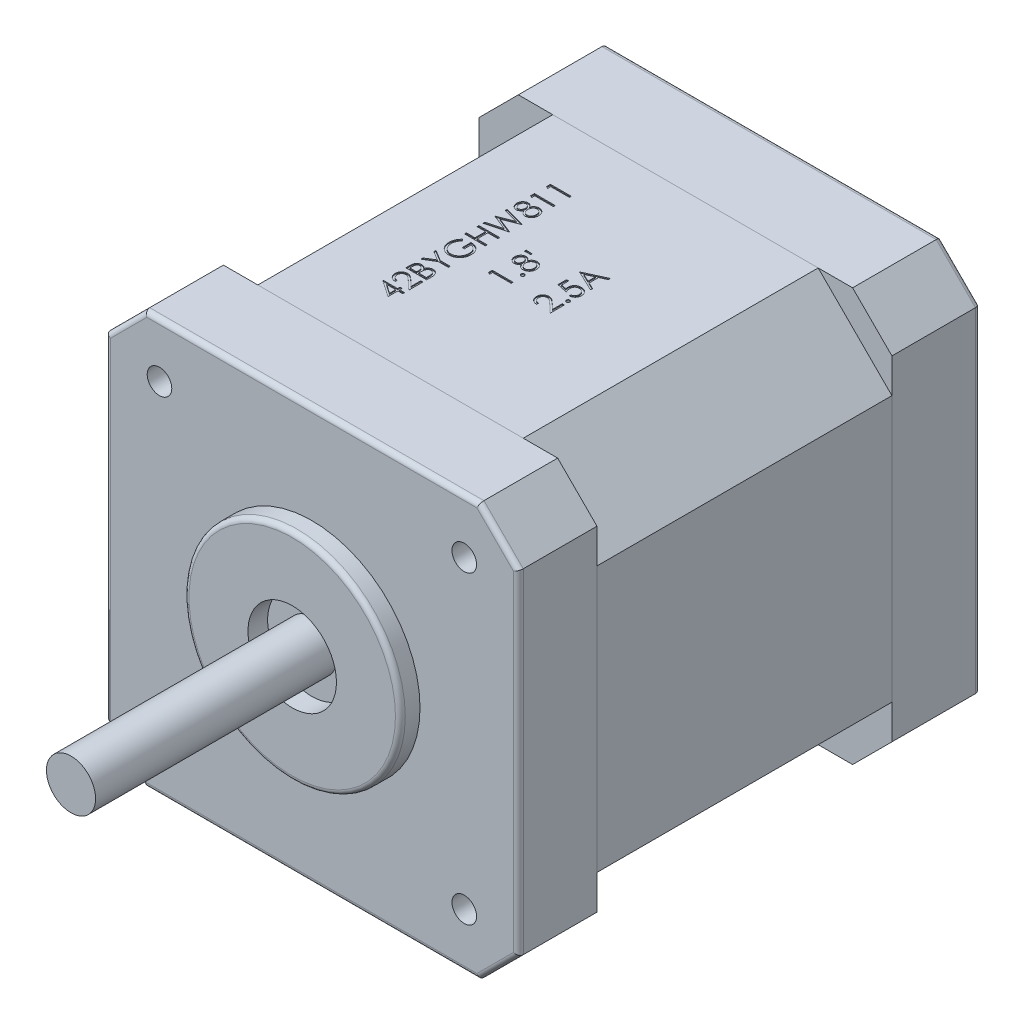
from build123d import *

# Parameters (mm, degrees)
IZIM1_R                     = 2.5
Y_KSEKLIK_EKSTR_ZYON1_DEPTH = 24.5
IZIM1_4_R                   = 11
IZIM1_4_R_2                 = 4.5
Y_KSEKLIK_EKSTR_ZYON2_DEPTH = 2
Y_KSEKLIK_EKSTR_ZYON3_START = -8
IZIM1_5_W                   = 42
IZIM1_5_H                   = 42
IZIM1_5_R                   = 11
IZIM1_5_R_2                 = 4.5
IZIM1_5_R_3                 = 2.5
Y_KSEKLIK_EKSTR_ZYON3_DEPTH = 8
PAH1_SIZE                   = 4
Y_KSEKLIK_EKSTR_ZYON4_DEPTH = 30
Y_KSEKLIK_EKSTR_ZYON5_DEPTH = 9
IZIM4_R                     = 4.5
KES_EKSTR_ZYON1_DEPTH       = 3.5
M3_DI_LI_DELIK1_D           = 2.5
M3_DI_LI_DELIK1_DEPTH       = 7
M3_DI_LI_DELIK1_TIP         = 0.751075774
RADYUS1_R                   = 0.5
RADYUS2_R                   = 0.5
KES_EKSTR_ZYON2_DEPTH       = 0.1
IZIM11_R                    = 0.6


with BuildPart() as part:
    # izim1 → Y_kseklik-Ekstr_zyon1 (new body)
    with BuildSketch(Plane.XY):
        Circle(IZIM1_R)
    extrude(amount=Y_KSEKLIK_EKSTR_ZYON1_DEPTH)



with BuildPart() as body_2:
    # izim1_4 → Y_kseklik-Ekstr_zyon2 (new body)
    with BuildSketch(Plane.XY):
        Circle(IZIM1_4_R)
        Circle(IZIM1_4_R_2, mode=Mode.SUBTRACT)
    extrude(amount=Y_KSEKLIK_EKSTR_ZYON2_DEPTH)


with BuildPart() as part_1:
    add(part.part)

    add(body_2.part)  # Y_kseklik-Ekstr_zyon3 merges body 2
    # izim1_5 → Y_kseklik-Ekstr_zyon3 (add)
    # profile 1 of 4: a face of its own
    with BuildSketch(Plane.XY.offset(Y_KSEKLIK_EKSTR_ZYON3_START)):
        Rectangle(IZIM1_5_W, IZIM1_5_H)
        Circle(IZIM1_5_R, mode=Mode.SUBTRACT)
    # profile 2 of 4: a face of its own
    with BuildSketch(Plane.XY.offset(Y_KSEKLIK_EKSTR_ZYON3_START)):
        Circle(IZIM1_5_R)
        Circle(IZIM1_5_R_2, mode=Mode.SUBTRACT)
    # profile 3 of 4: a face of its own
    with BuildSketch(Plane.XY.offset(Y_KSEKLIK_EKSTR_ZYON3_START)):
        Circle(IZIM1_5_R_2)
        Circle(IZIM1_5_R_3, mode=Mode.SUBTRACT)
    # profile 4 of 4: a face of its own
    with BuildSketch(Plane.XY.offset(Y_KSEKLIK_EKSTR_ZYON3_START)):
        Circle(IZIM1_5_R_3)
    extrude(amount=Y_KSEKLIK_EKSTR_ZYON3_DEPTH)

    # Pah1
    pah1_edges = [part_1.edges().sort_by_distance(p)[0] for p in [
        (-21, -21, -4),
        (-21, 21, -4),
        (21, 21, -4),
        (21, -21, -4),
    ]]
    chamfer(pah1_edges, length=PAH1_SIZE)

    # izim2 → Y_kseklik-Ekstr_zyon4 (add)
    with BuildSketch(Plane(origin=(0, 0, -8), x_dir=(-1, 0, 0), z_dir=(0, 0, -1))):
        Polygon((-13.5, 21), (13.5, 21), (21, 13.5), (21, -13.5), (13.5, -21), (-13.5, -21), (-21, -13.5), (-21, 13.5), align=None)
    extrude(amount=Y_KSEKLIK_EKSTR_ZYON4_DEPTH)

    # izim3 → Y_kseklik-Ekstr_zyon5 (add)
    with BuildSketch(Plane(origin=(0, 0, -38), x_dir=(-1, 0, 0), z_dir=(0, 0, -1))):
        Polygon((-17, -21), (17, -21), (21, -17), (21, 17), (17, 21), (-17, 21), (-21, 17), (-21, -17), align=None)
    extrude(amount=Y_KSEKLIK_EKSTR_ZYON5_DEPTH)

    # izim4 → Kes-Ekstr_zyon1 (cut)
    with BuildSketch(Plane(origin=(0, 0, -47), x_dir=(-1, 0, 0), z_dir=(0, 0, -1))):
        with Locations(Location((0, 0, 0), (0, 0, 180))):
            Circle(IZIM4_R)
    extrude(amount=-KES_EKSTR_ZYON1_DEPTH, mode=Mode.SUBTRACT)

    # M3 Di_li Delik1
    with Locations(Plane.XY):
        with Locations((-15.5, 15.5), (15.5, 15.5), (15.5, -15.5), (-15.5, -15.5)):
            Hole(M3_DI_LI_DELIK1_D / 2, depth=M3_DI_LI_DELIK1_DEPTH)
            with Locations((0, 0, -(M3_DI_LI_DELIK1_DEPTH + M3_DI_LI_DELIK1_TIP / 2))):  # 118° drill point
                Cone(0, M3_DI_LI_DELIK1_D / 2, M3_DI_LI_DELIK1_TIP, mode=Mode.SUBTRACT)

    # Radyus1
    radyus1_edges = [part_1.edges().sort_by_distance(p)[0] for p in [
        (-11, 0, 2),
    ]]
    fillet(radyus1_edges, radius=RADYUS1_R)

    # Radyus2
    radyus2_edges = [part_1.edges().sort_by_distance(p)[0] for p in [
        (-4.5, 0, -47),
        (0, -21, 0),
        (-21, 0, 0),
        (21, 0, 0),
        (0, 21, 0),
        (19, 19, 0),
        (-19, 19, 0),
        (-19, -19, 0),
        (19, -19, 0),
        (-19, -19, -47),
        (-21, 0, -47),
        (-19, 19, -47),
        (0, 21, -47),
        (19, 19, -47),
        (21, 0, -47),
        (19, -19, -47),
        (0, -21, -47),
    ]]
    fillet(radyus2_edges, radius=RADYUS2_R)

    # izim9 → Kes-Ekstr_zyon2 (cut)
    # profile 1 of 18: a face of its own
    with BuildSketch(Plane(origin=(0, 21, 0), x_dir=(1, 0, 0), z_dir=(0, 1, 0))):
        Polygon((-7.48076484, 31.358758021), (-7.48076484, 31.750120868), (-5.364098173, 31.750120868), (-5.364098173, 31.560163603), (-7.263670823, 31.560163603), (-7.263670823, 31.234522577), align=None)
    # profile 2 of 18: a face of its own
    with BuildSketch(Plane(origin=(0, 21, 0), x_dir=(1, 0, 0), z_dir=(0, 1, 0))):
        Polygon((-7.48076484, 29.730552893), (-7.48076484, 30.12191574), (-5.364098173, 30.12191574), (-5.364098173, 29.931958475), (-7.263670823, 29.931958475), (-7.263670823, 29.606317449), align=None)
    # profile 3 of 18: a face of its own
    with BuildSketch(Plane(origin=(0, 21, 0), x_dir=(1, 0, 0), z_dir=(0, 1, 0))):
        with BuildLine():
            add(Edge.make_bspline(
                [(-6.543274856, 28.681547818), (-6.534253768, 28.698882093), (-6.516659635, 28.732689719), (-6.488152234, 28.780626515), (-6.45888197, 28.825043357), (-6.428289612, 28.865697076), (-6.397059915, 28.90310779), (-6.364791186, 28.936723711), (-6.331527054, 28.966686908), (-6.297144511, 28.992949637), (-6.261637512, 29.01619211), (-6.224780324, 29.035908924), (-6.187070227, 29.053109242), (-6.147944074, 29.066611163), (-6.107936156, 29.077758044), (-6.066510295, 29.085422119), (-6.023944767, 29.089545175), (-5.995177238, 29.09032454), (-5.980611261, 29.090719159)],
                knots=[0, 0, 0, 0, 1.272232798, 2.48127884, 3.629933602, 4.734339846, 5.792529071, 6.8014233, 7.765980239, 8.70477066, 9.616091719, 10.526157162, 11.424183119, 12.311964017, 13.218439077, 14.126407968, 15.05133675, 16, 16, 16, 16], degree=3))
            add(Edge.make_bspline(
                [(-5.980611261, 29.090719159), (-5.960232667, 29.090251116), (-5.919895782, 29.089324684), (-5.860351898, 29.081303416), (-5.802424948, 29.069151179), (-5.746227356, 29.051848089), (-5.69229116, 29.028724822), (-5.640304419, 29.000759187), (-5.589380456, 28.968920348), (-5.558040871, 28.943370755), (-5.542183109, 28.930442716)],
                knots=[0, 0, 0, 0, 1.025234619, 2.029323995, 3.018511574, 4.001747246, 4.983437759, 5.966776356, 6.971193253, 8, 8, 8, 8], degree=3))
            add(Edge.make_bspline(
                [(-5.542183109, 28.930442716), (-5.52368116, 28.913608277), (-5.486905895, 28.880147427), (-5.439159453, 28.822826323), (-5.399033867, 28.75991785), (-5.366333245, 28.69166543), (-5.340881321, 28.618251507), (-5.322591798, 28.539691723), (-5.312115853, 28.455832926), (-5.310601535, 28.398195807), (-5.309824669, 28.368627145)],
                knots=[0, 0, 0, 0, 0.954267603, 1.896743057, 2.838368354, 3.796610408, 4.779680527, 5.799409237, 6.871065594, 8, 8, 8, 8], degree=3))
            add(Edge.make_bspline(
                [(-5.309824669, 28.368627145), (-5.310521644, 28.340195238), (-5.311877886, 28.284869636), (-5.321066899, 28.204340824), (-5.33717042, 28.129275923), (-5.359210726, 28.059238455), (-5.387882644, 27.994650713), (-5.423568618, 27.935696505), (-5.464832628, 27.881526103), (-5.512858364, 27.833780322), (-5.564301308, 27.79140065), (-5.617358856, 27.754141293), (-5.671990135, 27.723346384), (-5.72736472, 27.69680369), (-5.784604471, 27.677050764), (-5.843122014, 27.663040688), (-5.902751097, 27.654240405), (-5.942985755, 27.653063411), (-5.963226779, 27.652471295)],
                knots=[0, 0, 0, 0, 1.25688423, 2.445769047, 3.576901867, 4.645929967, 5.686364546, 6.692558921, 7.686102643, 8.689032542, 9.678639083, 10.630214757, 11.550908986, 12.44815258, 13.341318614, 14.221806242, 15.105436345, 16, 16, 16, 16], degree=3))
            add(Edge.make_bspline(
                [(-5.963226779, 27.652471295), (-5.978079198, 27.652820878), (-6.00743282, 27.653511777), (-6.050800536, 27.658290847), (-6.093008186, 27.665981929), (-6.134225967, 27.676399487), (-6.174223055, 27.690664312), (-6.213255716, 27.707526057), (-6.251068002, 27.727571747), (-6.287940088, 27.750584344), (-6.323431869, 27.777375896), (-6.358116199, 27.807734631), (-6.391556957, 27.84206515), (-6.423561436, 27.880612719), (-6.45578492, 27.922023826), (-6.485840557, 27.968050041), (-6.516002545, 28.017229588), (-6.534028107, 28.052189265), (-6.543274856, 28.070122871)],
                knots=[0, 0, 0, 0, 0.941515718, 1.860767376, 2.762381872, 3.659935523, 4.55260077, 5.451495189, 6.353332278, 7.263234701, 8.204067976, 9.169206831, 10.183030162, 11.238523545, 12.34427893, 13.507326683, 14.721309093, 16, 16, 16, 16], degree=3))
            add(Edge.make_bspline(
                [(-6.543274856, 28.070122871), (-6.556702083, 28.045607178), (-6.582660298, 27.998212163), (-6.629722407, 27.934815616), (-6.681807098, 27.881200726), (-6.738380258, 27.837324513), (-6.798312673, 27.802960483), (-6.861105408, 27.779355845), (-6.925645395, 27.763394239), (-6.969735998, 27.761812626), (-6.99187929, 27.761018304)],
                knots=[0, 0, 0, 0, 1.166795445, 2.255709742, 3.287146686, 4.280506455, 5.237809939, 6.161201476, 7.076514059, 8, 8, 8, 8], degree=3))
            add(Edge.make_bspline(
                [(-6.99187929, 27.761018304), (-7.014434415, 27.762009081), (-7.059774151, 27.764000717), (-7.12728494, 27.780050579), (-7.193629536, 27.806401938), (-7.258645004, 27.841636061), (-7.319404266, 27.886451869), (-7.37415459, 27.939508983), (-7.422098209, 28.000380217), (-7.462366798, 28.068502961), (-7.495133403, 28.141824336), (-7.517738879, 28.219182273), (-7.532516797, 28.29923265), (-7.53418998, 28.353720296), (-7.535038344, 28.381347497)],
                knots=[0, 0, 0, 0, 0.888671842, 1.786385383, 2.719922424, 3.697584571, 4.694127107, 5.68736021, 6.695307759, 7.740011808, 8.800474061, 9.853175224, 10.911482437, 12, 12, 12, 12], degree=3))
            add(Edge.make_bspline(
                [(-7.535038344, 28.381347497), (-7.534163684, 28.408261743), (-7.532438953, 28.46133357), (-7.518053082, 28.539344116), (-7.49402796, 28.613988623), (-7.46142632, 28.684998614), (-7.421302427, 28.751143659), (-7.372657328, 28.809394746), (-7.318552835, 28.861275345), (-7.257447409, 28.903949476), (-7.192682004, 28.938908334), (-7.125097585, 28.963521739), (-7.05605486, 28.979196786), (-7.009345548, 28.981179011), (-6.985943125, 28.98217215)],
                knots=[0, 0, 0, 0, 1.072838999, 2.115516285, 3.151283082, 4.193045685, 5.225601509, 6.226687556, 7.21162948, 8.206378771, 9.189883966, 10.138656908, 11.067424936, 12, 12, 12, 12], degree=3))
            add(Edge.make_bspline(
                [(-6.985943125, 28.98217215), (-6.962978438, 28.981299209), (-6.917877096, 28.979584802), (-6.852222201, 28.965356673), (-6.790871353, 28.941012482), (-6.732836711, 28.908206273), (-6.679294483, 28.86507899), (-6.6291198, 28.813003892), (-6.582888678, 28.751435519), (-6.556755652, 28.705330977), (-6.543274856, 28.681547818)],
                knots=[0, 0, 0, 0, 0.97540661, 1.915643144, 2.83819279, 3.771804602, 4.738123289, 5.749225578, 6.838931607, 8, 8, 8, 8], degree=3))
        make_face()
        with BuildLine():
            add(Edge.make_bspline(
                [(-7.317944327, 28.370747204), (-7.317551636, 28.355899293), (-7.31678336, 28.326850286), (-7.312738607, 28.284264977), (-7.304969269, 28.243736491), (-7.294325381, 28.205043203), (-7.281082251, 28.168052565), (-7.263633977, 28.133612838), (-7.244240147, 28.10056665), (-7.221492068, 28.069998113), (-7.196673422, 28.042325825), (-7.170754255, 28.017609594), (-7.142970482, 27.997473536), (-7.114712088, 27.980149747), (-7.084806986, 27.967284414), (-7.053909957, 27.958145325), (-7.021825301, 27.951677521), (-6.999967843, 27.951211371), (-6.988911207, 27.950975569)],
                knots=[0, 0, 0, 0, 1.20353747, 2.354645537, 3.462130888, 4.543058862, 5.604822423, 6.639552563, 7.666902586, 8.706944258, 9.720926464, 10.677177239, 11.602682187, 12.496457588, 13.358248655, 14.231532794, 15.105417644, 16, 16, 16, 16], degree=3))
            add(Edge.make_bspline(
                [(-6.988911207, 27.950975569), (-6.977855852, 27.951391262), (-6.95600888, 27.952212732), (-6.923747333, 27.958565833), (-6.892044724, 27.968034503), (-6.861654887, 27.982942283), (-6.831523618, 28.000822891), (-6.802403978, 28.022891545), (-6.774194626, 28.049192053), (-6.747135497, 28.078841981), (-6.721796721, 28.111143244), (-6.699799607, 28.145363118), (-6.681394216, 28.181072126), (-6.666075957, 28.217903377), (-6.654168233, 28.256232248), (-6.645720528, 28.295823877), (-6.640469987, 28.336684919), (-6.639842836, 28.36437127), (-6.639525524, 28.378379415)],
                knots=[0, 0, 0, 0, 0.873023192, 1.725219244, 2.590779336, 3.480155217, 4.391973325, 5.357036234, 6.360879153, 7.436073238, 8.526419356, 9.601555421, 10.645666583, 11.697338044, 12.750135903, 13.812665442, 14.89329948, 16, 16, 16, 16], degree=3))
            add(Edge.make_bspline(
                [(-6.639525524, 28.378379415), (-6.640050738, 28.396372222), (-6.641095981, 28.432180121), (-6.650902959, 28.484947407), (-6.666134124, 28.536383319), (-6.68775201, 28.585514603), (-6.714109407, 28.631461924), (-6.745192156, 28.672929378), (-6.781730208, 28.708181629), (-6.821604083, 28.738172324), (-6.86390063, 28.761620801), (-6.906519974, 28.779582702), (-6.949813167, 28.790160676), (-6.978822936, 28.791535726), (-6.993151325, 28.792214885)],
                knots=[0, 0, 0, 0, 1.076561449, 2.142489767, 3.202892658, 4.283174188, 5.348766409, 6.369549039, 7.375093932, 8.378927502, 9.349008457, 10.26378795, 11.142457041, 12, 12, 12, 12], degree=3))
            add(Edge.make_bspline(
                [(-6.993151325, 28.792214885), (-7.003208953, 28.791898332), (-7.023171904, 28.791270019), (-7.052756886, 28.785909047), (-7.081652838, 28.777481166), (-7.109919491, 28.765419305), (-7.137420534, 28.749929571), (-7.164886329, 28.731822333), (-7.191047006, 28.709350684), (-7.216810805, 28.684346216), (-7.240584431, 28.655928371), (-7.261647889, 28.624368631), (-7.278821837, 28.589299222), (-7.293409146, 28.551471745), (-7.304213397, 28.51047856), (-7.312352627, 28.466704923), (-7.316928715, 28.419746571), (-7.317598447, 28.387434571), (-7.317944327, 28.370747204)],
                knots=[0, 0, 0, 0, 0.814197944, 1.616066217, 2.427603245, 3.248455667, 4.099186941, 4.981981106, 5.90846497, 6.888109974, 7.887887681, 8.904052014, 9.953721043, 11.044545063, 12.183287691, 13.382474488, 14.648192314, 16, 16, 16, 16], degree=3))
        make_face(mode=Mode.SUBTRACT)
        with BuildLine():
            add(Edge.make_bspline(
                [(-6.422431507, 28.383043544), (-6.422096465, 28.364219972), (-6.421439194, 28.327292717), (-6.414131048, 28.273190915), (-6.403941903, 28.221276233), (-6.388542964, 28.17168812), (-6.368341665, 28.124639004), (-6.344792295, 28.079324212), (-6.316131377, 28.03684936), (-6.283567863, 27.997301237), (-6.248453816, 27.96101112), (-6.210896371, 27.929614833), (-6.172350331, 27.90254782), (-6.131936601, 27.880901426), (-6.090547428, 27.863107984), (-6.04711952, 27.851429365), (-6.002496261, 27.84394093), (-5.972161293, 27.842935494), (-5.956866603, 27.84242856)],
                knots=[0, 0, 0, 0, 1.140120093, 2.236637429, 3.303440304, 4.343881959, 5.376465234, 6.40341898, 7.434544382, 8.475444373, 9.50525236, 10.49018835, 11.438301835, 12.354413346, 13.264416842, 14.162243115, 15.073415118, 16, 16, 16, 16], degree=3))
            add(Edge.make_bspline(
                [(-5.956866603, 27.84242856), (-5.937862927, 27.84327052), (-5.900022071, 27.844947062), (-5.844216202, 27.857702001), (-5.790358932, 27.878811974), (-5.738701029, 27.907713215), (-5.690391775, 27.943721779), (-5.648173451, 27.987785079), (-5.611265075, 28.037810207), (-5.580842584, 28.094558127), (-5.556856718, 28.156851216), (-5.539481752, 28.22412554), (-5.528641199, 28.295910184), (-5.527501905, 28.345408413), (-5.526918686, 28.370747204)],
                knots=[0, 0, 0, 0, 0.898929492, 1.789983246, 2.69439732, 3.628772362, 4.584083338, 5.535003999, 6.506411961, 7.518169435, 8.572915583, 9.658441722, 10.801325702, 12, 12, 12, 12], degree=3))
            add(Edge.make_bspline(
                [(-5.526918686, 28.370747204), (-5.527303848, 28.390551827), (-5.528054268, 28.429137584), (-5.534526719, 28.485453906), (-5.545131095, 28.538463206), (-5.559367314, 28.588598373), (-5.578594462, 28.635440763), (-5.602096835, 28.679192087), (-5.629096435, 28.72040248), (-5.661048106, 28.757216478), (-5.695208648, 28.790738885), (-5.731366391, 28.819969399), (-5.768544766, 28.845343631), (-5.807582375, 28.865259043), (-5.847730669, 28.881180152), (-5.889359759, 28.892624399), (-5.932597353, 28.899685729), (-5.961927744, 28.90039989), (-5.976795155, 28.900761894)],
                knots=[0, 0, 0, 0, 1.224881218, 2.3864614, 3.501053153, 4.5663711, 5.605533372, 6.626474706, 7.635288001, 8.646258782, 9.635558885, 10.592810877, 11.51917626, 12.414699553, 13.29797396, 14.186770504, 15.080884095, 16, 16, 16, 16], degree=3))
            add(Edge.make_bspline(
                [(-5.976795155, 28.900761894), (-5.991235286, 28.9002141), (-6.019708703, 28.899133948), (-6.061900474, 28.892277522), (-6.102664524, 28.880234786), (-6.142482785, 28.863702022), (-6.18058093, 28.84172416), (-6.21791194, 28.8156582), (-6.253837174, 28.784686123), (-6.287855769, 28.749188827), (-6.319293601, 28.710694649), (-6.34723457, 28.669905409), (-6.370070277, 28.626627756), (-6.389254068, 28.581720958), (-6.404204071, 28.534731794), (-6.414687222, 28.485887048), (-6.421275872, 28.43509415), (-6.422041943, 28.400589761), (-6.422431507, 28.383043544)],
                knots=[0, 0, 0, 0, 0.917285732, 1.808727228, 2.70647511, 3.61182169, 4.540502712, 5.494399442, 6.50027777, 7.547876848, 8.61347749, 9.654284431, 10.682470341, 11.71628462, 12.752590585, 13.809114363, 14.885888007, 16, 16, 16, 16], degree=3))
        make_face(mode=Mode.SUBTRACT)
    # profile 4 of 18: a face of its own
    with BuildSketch(Plane(origin=(0, 21, 0), x_dir=(1, 0, 0), z_dir=(0, 1, 0))):
        Polygon((-7.48076484, 24.884522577), (-7.48076484, 25.080840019), (-5.928457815, 25.495099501), (-7.48076484, 26.111188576), (-7.48076484, 26.13874934), (-5.939058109, 26.743390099), (-7.48076484, 27.159769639), (-7.48076484, 27.353967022), (-5.364098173, 26.783247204), (-5.364098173, 26.756110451), (-6.982975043, 26.1192448), (-5.364098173, 25.474746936), (-5.364098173, 25.447610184), align=None)
    # profile 5 of 18: a face of its own
    with BuildSketch(Plane(origin=(0, 21, 0), x_dir=(1, 0, 0), z_dir=(0, 1, 0))):
        Polygon((-7.48076484, 23.01208668), (-7.48076484, 23.202043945), (-6.612388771, 23.202043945), (-6.612388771, 24.28751403), (-7.48076484, 24.28751403), (-7.48076484, 24.477471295), (-5.364098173, 24.477471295), (-5.364098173, 24.28751403), (-6.395294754, 24.28751403), (-6.395294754, 23.202043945), (-5.364098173, 23.202043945), (-5.364098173, 23.01208668), align=None)
    # profile 6 of 18: a face of its own
    with BuildSketch(Plane(origin=(0, 21, 0), x_dir=(1, 0, 0), z_dir=(0, 1, 0))):
        with BuildLine():
            Line((-7.119506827, 22.442214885), (-6.965166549, 22.279394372))
            add(Edge.make_bspline(
                [(-6.965166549, 22.279394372), (-6.992892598, 22.249936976), (-7.047683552, 22.191724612), (-7.118660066, 22.096656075), (-7.180063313, 21.997864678), (-7.229651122, 21.895190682), (-7.268550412, 21.791326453), (-7.296826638, 21.688057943), (-7.314733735, 21.586053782), (-7.316884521, 21.518221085), (-7.317944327, 21.484796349)],
                knots=[0, 0, 0, 0, 1.089067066, 2.152164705, 3.18986567, 4.218445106, 5.218487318, 6.173592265, 7.100032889, 8, 8, 8, 8], degree=3))
            add(Edge.make_bspline(
                [(-7.317944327, 21.484796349), (-7.317694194, 21.46428603), (-7.317194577, 21.423318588), (-7.310817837, 21.362466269), (-7.301646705, 21.30225216), (-7.288377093, 21.242789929), (-7.271559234, 21.18396396), (-7.250522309, 21.125978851), (-7.225996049, 21.068726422), (-7.197655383, 21.01274602), (-7.166522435, 20.958474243), (-7.132021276, 20.907217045), (-7.095259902, 20.858644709), (-7.055309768, 20.813681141), (-7.012562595, 20.772027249), (-6.96778822, 20.732916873), (-6.920106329, 20.697078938), (-6.869713, 20.665156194), (-6.817780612, 20.636328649), (-6.764749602, 20.611417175), (-6.711112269, 20.589760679), (-6.656464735, 20.573266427), (-6.601370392, 20.559295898), (-6.54554052, 20.549570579), (-6.488829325, 20.544069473), (-6.45085167, 20.5431197), (-6.431759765, 20.542642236)],
                knots=[0, 0, 0, 0, 1.028150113, 2.053633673, 3.06513288, 4.081487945, 5.106702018, 6.131327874, 7.172780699, 8.228344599, 9.276313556, 10.308389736, 11.324843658, 12.329040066, 13.321460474, 14.316307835, 15.308626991, 16.309440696, 17.305625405, 18.28535951, 19.246194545, 20.203493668, 21.145557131, 22.095268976, 23.042464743, 24, 24, 24, 24], degree=3))
            add(Edge.make_bspline(
                [(-6.431759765, 20.542642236), (-6.412243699, 20.543099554), (-6.373264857, 20.544012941), (-6.315088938, 20.549850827), (-6.257783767, 20.560709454), (-6.20125921, 20.575109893), (-6.145402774, 20.593417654), (-6.090272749, 20.615910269), (-6.035874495, 20.642704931), (-5.982748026, 20.673651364), (-5.931040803, 20.707826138), (-5.88192659, 20.745412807), (-5.835976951, 20.78647465), (-5.792520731, 20.830258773), (-5.751832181, 20.877164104), (-5.714401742, 20.927645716), (-5.679650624, 20.98099696), (-5.647960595, 21.037241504), (-5.619653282, 21.095784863), (-5.594480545, 21.155811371), (-5.573749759, 21.217513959), (-5.556853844, 21.280568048), (-5.543004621, 21.344898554), (-5.534094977, 21.410831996), (-5.52762957, 21.477883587), (-5.527156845, 21.523082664), (-5.526918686, 21.545854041)],
                knots=[0, 0, 0, 0, 0.935915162, 1.869274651, 2.799799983, 3.730201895, 4.664668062, 5.616159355, 6.583070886, 7.570012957, 8.562524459, 9.553461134, 10.53281078, 11.515274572, 12.509912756, 13.507571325, 14.526460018, 15.561318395, 16.601025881, 17.643204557, 18.680545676, 19.719612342, 20.772381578, 21.833430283, 22.908478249, 24, 24, 24, 24], degree=3))
            add(Edge.make_bspline(
                [(-5.526918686, 21.545854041), (-5.527492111, 21.573297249), (-5.528618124, 21.627186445), (-5.537390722, 21.70640047), (-5.55107435, 21.782487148), (-5.571176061, 21.855198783), (-5.596619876, 21.924799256), (-5.628084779, 21.991031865), (-5.665239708, 22.054079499), (-5.707332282, 22.113669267), (-5.75423064, 22.168384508), (-5.804386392, 22.21818186), (-5.858449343, 22.261348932), (-5.915613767, 22.299175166), (-5.976426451, 22.33043969), (-6.040549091, 22.35610934), (-6.108021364, 22.37578373), (-6.154643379, 22.383860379), (-6.178200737, 22.387941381)],
                knots=[0, 0, 0, 0, 1.130199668, 2.219330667, 3.279027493, 4.311506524, 5.322739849, 6.327972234, 7.327472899, 8.33386792, 9.329086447, 10.29244429, 11.240784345, 12.174119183, 13.111530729, 14.052100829, 15.015757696, 16, 16, 16, 16], degree=3))
            Line((-6.178200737, 22.387941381), (-6.178200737, 21.682385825))
            Line((-6.178200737, 21.682385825), (-6.395294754, 21.682385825))
            Line((-6.395294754, 21.682385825), (-6.395294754, 22.577898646))
            add(Edge.make_bspline(
                [(-6.395294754, 22.577898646), (-6.354831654, 22.576867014), (-6.275638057, 22.574847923), (-6.160146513, 22.560685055), (-6.051064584, 22.537815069), (-5.948277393, 22.506572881), (-5.851930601, 22.466129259), (-5.761926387, 22.416918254), (-5.678846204, 22.358152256), (-5.602011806, 22.291924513), (-5.533474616, 22.217599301), (-5.473236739, 22.137184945), (-5.422495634, 22.050548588), (-5.381214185, 21.95777218), (-5.348996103, 21.859159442), (-5.326153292, 21.754482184), (-5.312467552, 21.643882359), (-5.310718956, 21.568083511), (-5.309824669, 21.529317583)],
                knots=[0, 0, 0, 0, 1.140356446, 2.231883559, 3.274166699, 4.278491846, 5.25512956, 6.21435461, 7.1637429, 8.11826594, 9.068280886, 10.0076534, 10.945064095, 11.891975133, 12.864533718, 13.863980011, 14.907571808, 16, 16, 16, 16], degree=3))
            add(Edge.make_bspline(
                [(-5.309824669, 21.529317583), (-5.310168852, 21.505423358), (-5.310847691, 21.458296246), (-5.315672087, 21.388693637), (-5.323098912, 21.321010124), (-5.334314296, 21.255255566), (-5.348051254, 21.191188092), (-5.365641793, 21.129127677), (-5.38600334, 21.068837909), (-5.409163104, 21.010225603), (-5.435997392, 20.953822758), (-5.465817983, 20.89937815), (-5.498471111, 20.846590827), (-5.53452148, 20.79582036), (-5.573699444, 20.746802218), (-5.616083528, 20.699852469), (-5.661544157, 20.654708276), (-5.693825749, 20.626429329), (-5.710091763, 20.612180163)],
                knots=[0, 0, 0, 0, 1.107784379, 2.184907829, 3.233506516, 4.263428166, 5.276301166, 6.270063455, 7.25232949, 8.225834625, 9.190232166, 10.146266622, 11.1027726, 12.066435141, 13.031522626, 14.010570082, 14.99756817, 16, 16, 16, 16], degree=3))
            add(Edge.make_bspline(
                [(-5.710091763, 20.612180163), (-5.735897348, 20.591505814), (-5.787080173, 20.550500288), (-5.869085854, 20.497717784), (-5.95399555, 20.45272265), (-6.042045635, 20.41621449), (-6.133153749, 20.387707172), (-6.227203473, 20.367262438), (-6.324315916, 20.355283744), (-6.390032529, 20.353558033), (-6.42327953, 20.352684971)],
                knots=[0, 0, 0, 0, 1.023165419, 2.029347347, 3.013907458, 3.994755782, 4.975994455, 5.96558838, 6.970761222, 8, 8, 8, 8], degree=3))
            add(Edge.make_bspline(
                [(-6.42327953, 20.352684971), (-6.448175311, 20.353006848), (-6.497650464, 20.353646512), (-6.571103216, 20.361402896), (-6.643251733, 20.372531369), (-6.714037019, 20.38888841), (-6.783506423, 20.409508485), (-6.851691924, 20.43524339), (-6.918634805, 20.46520558), (-6.983870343, 20.500033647), (-7.046547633, 20.538779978), (-7.106359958, 20.580876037), (-7.162337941, 20.626646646), (-7.214611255, 20.676225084), (-7.263954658, 20.728611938), (-7.309337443, 20.784906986), (-7.351469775, 20.844257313), (-7.389542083, 20.907123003), (-7.423752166, 20.972512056), (-7.453741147, 21.040282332), (-7.47852648, 21.110409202), (-7.499556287, 21.182368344), (-7.515107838, 21.256704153), (-7.526385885, 21.332877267), (-7.534103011, 21.411284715), (-7.534723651, 21.464283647), (-7.535038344, 21.491156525)],
                knots=[0, 0, 0, 0, 1.00895651, 2.005089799, 2.991467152, 3.967318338, 4.948153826, 5.927364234, 6.919980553, 7.91976625, 8.923240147, 9.905815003, 10.88314567, 11.851989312, 12.825009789, 13.798721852, 14.781296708, 15.773896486, 16.776076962, 17.771600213, 18.775744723, 19.78957137, 20.808953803, 21.851964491, 22.910847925, 24, 24, 24, 24], degree=3))
            add(Edge.make_bspline(
                [(-7.535038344, 21.491156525), (-7.53468789, 21.513072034), (-7.533992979, 21.556527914), (-7.529176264, 21.621192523), (-7.521541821, 21.684857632), (-7.511123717, 21.74761764), (-7.496933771, 21.809258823), (-7.479953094, 21.869956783), (-7.460182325, 21.929799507), (-7.436603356, 21.988599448), (-7.40984045, 22.046751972), (-7.379715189, 22.104580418), (-7.345712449, 22.1618872), (-7.307731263, 22.218771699), (-7.266423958, 22.275592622), (-7.220609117, 22.331451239), (-7.17209345, 22.387695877), (-7.137209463, 22.423861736), (-7.119506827, 22.442214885)],
                knots=[0, 0, 0, 0, 0.985871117, 1.954866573, 2.915460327, 3.869826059, 4.81536089, 5.759505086, 6.70452669, 7.649098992, 8.607881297, 9.583363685, 10.581137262, 11.603961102, 12.659522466, 13.73993555, 14.853081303, 16, 16, 16, 16], degree=3))
        make_face()
    # profile 7 of 18: a face of its own
    with BuildSketch(Plane(origin=(0, 21, 0), x_dir=(1, 0, 0), z_dir=(0, 1, 0))):
        Polygon((-7.48076484, 18.56165933), (-7.48076484, 18.779177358), (-6.571259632, 19.335480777), (-7.48076484, 19.890936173), (-7.48076484, 20.108454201), (-6.370278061, 19.430035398), (-5.364098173, 19.430035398), (-5.364098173, 19.240078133), (-6.370278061, 19.240078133), align=None)
    # profile 8 of 18: a face of its own
    with BuildSketch(Plane(origin=(0, 21, 0), x_dir=(1, 0, 0), z_dir=(0, 1, 0))):
        with BuildLine():
            Line((-7.48076484, 17.04200121), (-7.48076484, 17.454988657))
            add(Edge.make_bspline(
                [(-7.48076484, 17.454988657), (-7.480660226, 17.475205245), (-7.480457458, 17.514390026), (-7.477239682, 17.571366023), (-7.472961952, 17.624750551), (-7.46578629, 17.674449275), (-7.458346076, 17.720785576), (-7.447425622, 17.763289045), (-7.435363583, 17.802315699), (-7.4168045, 17.849178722), (-7.387982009, 17.902351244), (-7.345235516, 17.959501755), (-7.293985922, 18.009180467), (-7.235582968, 18.051422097), (-7.1713331, 18.085321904), (-7.102618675, 18.109536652), (-7.030595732, 18.125093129), (-6.981217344, 18.126672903), (-6.956262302, 18.127471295)],
                knots=[0, 0, 0, 0, 1.00128172, 1.940733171, 2.826250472, 3.653024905, 4.427672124, 5.149348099, 5.824709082, 6.450061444, 7.643590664, 8.808605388, 9.972104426, 11.165284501, 12.367876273, 13.557044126, 14.765369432, 16, 16, 16, 16], degree=3))
            add(Edge.make_bspline(
                [(-6.956262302, 18.127471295), (-6.932887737, 18.126806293), (-6.886954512, 18.1254995), (-6.819887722, 18.113155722), (-6.756111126, 18.093564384), (-6.695679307, 18.066488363), (-6.639717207, 18.031602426), (-6.588398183, 17.989804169), (-6.543661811, 17.939583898), (-6.518661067, 17.901938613), (-6.505961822, 17.882816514)],
                knots=[0, 0, 0, 0, 1.044641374, 2.052818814, 3.038628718, 4.023282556, 5.005660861, 5.98021751, 6.974042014, 8, 8, 8, 8], degree=3))
            add(Edge.make_bspline(
                [(-6.505961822, 17.882816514), (-6.496727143, 17.906859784), (-6.479058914, 17.952860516), (-6.447870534, 18.016200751), (-6.413825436, 18.070573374), (-6.377220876, 18.117040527), (-6.337183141, 18.156572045), (-6.293386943, 18.190808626), (-6.245868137, 18.220406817), (-6.194801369, 18.245594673), (-6.140619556, 18.265380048), (-6.083984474, 18.279922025), (-6.025113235, 18.28852392), (-5.985162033, 18.28969735), (-5.964922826, 18.290291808)],
                knots=[0, 0, 0, 0, 1.272586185, 2.434772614, 3.483318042, 4.437947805, 5.351807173, 6.25737843, 7.180033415, 8.1141739, 9.066731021, 10.025721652, 10.999834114, 12, 12, 12, 12], degree=3))
            add(Edge.make_bspline(
                [(-5.964922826, 18.290291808), (-5.944259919, 18.289701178), (-5.903605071, 18.288539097), (-5.843882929, 18.279961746), (-5.786804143, 18.265448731), (-5.73202582, 18.245423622), (-5.679662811, 18.219467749), (-5.62990481, 18.18742377), (-5.582648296, 18.149741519), (-5.537809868, 18.107154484), (-5.496781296, 18.059694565), (-5.461510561, 18.007390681), (-5.431182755, 17.951675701), (-5.406490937, 17.891837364), (-5.387441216, 17.828028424), (-5.3741688, 17.760284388), (-5.365210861, 17.68871682), (-5.364475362, 17.639603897), (-5.364098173, 17.614417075)],
                knots=[0, 0, 0, 0, 0.978680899, 1.925582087, 2.851223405, 3.764209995, 4.683484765, 5.614004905, 6.562443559, 7.542772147, 8.539900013, 9.527881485, 10.525548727, 11.540192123, 12.58875426, 13.674701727, 14.807505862, 16, 16, 16, 16], degree=3))
            Line((-5.364098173, 17.614417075), (-5.364098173, 17.04200121))
            Line((-5.364098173, 17.04200121), (-7.48076484, 17.04200121))
        make_face()
        with BuildLine():
            Line((-7.263670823, 17.231958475), (-6.585252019, 17.231958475))
            Line((-6.585252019, 17.231958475), (-6.585252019, 17.359586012))
            add(Edge.make_bspline(
                [(-6.585252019, 17.359586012), (-6.585493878, 17.378242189), (-6.585961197, 17.414289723), (-6.587299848, 17.466492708), (-6.591048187, 17.514949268), (-6.594795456, 17.559575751), (-6.600888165, 17.600301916), (-6.608140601, 17.637037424), (-6.615810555, 17.670359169), (-6.628855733, 17.708784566), (-6.64812889, 17.752377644), (-6.678068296, 17.798819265), (-6.71369997, 17.83995143), (-6.755198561, 17.874268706), (-6.800397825, 17.902602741), (-6.848900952, 17.922451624), (-6.899731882, 17.935684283), (-6.934694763, 17.936897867), (-6.952446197, 17.93751403)],
                knots=[0, 0, 0, 0, 1.156917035, 2.235399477, 3.236897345, 4.169954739, 5.01148057, 5.788325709, 6.491867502, 7.129259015, 8.302032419, 9.437271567, 10.542795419, 11.662606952, 12.764338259, 13.836858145, 14.901724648, 16, 16, 16, 16], degree=3))
            add(Edge.make_bspline(
                [(-6.952446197, 17.93751403), (-6.964195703, 17.93720118), (-6.987243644, 17.936587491), (-7.020951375, 17.931378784), (-7.052624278, 17.922939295), (-7.082566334, 17.911509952), (-7.110033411, 17.895895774), (-7.136337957, 17.87779689), (-7.159904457, 17.855451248), (-7.181867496, 17.830198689), (-7.201524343, 17.801305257), (-7.217806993, 17.768148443), (-7.232564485, 17.731585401), (-7.243489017, 17.690624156), (-7.25309543, 17.646113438), (-7.259131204, 17.597450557), (-7.263015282, 17.544943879), (-7.263447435, 17.508563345), (-7.263670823, 17.48975762)],
                knots=[0, 0, 0, 0, 0.911708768, 1.788416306, 2.640049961, 3.452993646, 4.268229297, 5.087074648, 5.92553149, 6.781184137, 7.681934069, 8.628939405, 9.643570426, 10.73771997, 11.914765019, 13.176320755, 14.540391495, 16, 16, 16, 16], degree=3))
            Line((-7.263670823, 17.48975762), (-7.263670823, 17.231958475))
        make_face(mode=Mode.SUBTRACT)
        with BuildLine():
            Line((-6.368158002, 17.231958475), (-5.58119219, 17.231958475))
            Line((-5.58119219, 17.231958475), (-5.58119219, 17.502477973))
            add(Edge.make_bspline(
                [(-5.58119219, 17.502477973), (-5.581447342, 17.521839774), (-5.581939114, 17.559157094), (-5.583092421, 17.613079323), (-5.587455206, 17.662926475), (-5.591479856, 17.708855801), (-5.598361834, 17.750745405), (-5.604856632, 17.788917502), (-5.614497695, 17.822745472), (-5.627748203, 17.862332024), (-5.648960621, 17.906580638), (-5.679951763, 17.954936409), (-5.718199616, 17.997101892), (-5.761699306, 18.033297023), (-5.808866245, 18.063166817), (-5.859083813, 18.08460122), (-5.911375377, 18.097921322), (-5.947037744, 18.099528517), (-5.964922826, 18.100334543)],
                knots=[0, 0, 0, 0, 1.160376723, 2.23647316, 3.230273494, 4.158083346, 4.997711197, 5.773399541, 6.476071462, 7.102777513, 8.27340052, 9.405620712, 10.53304798, 11.669441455, 12.787990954, 13.865552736, 14.929550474, 16, 16, 16, 16], degree=3))
            add(Edge.make_bspline(
                [(-5.964922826, 18.100334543), (-5.976107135, 18.100168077), (-5.998295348, 18.09983783), (-6.03089807, 18.09483467), (-6.062495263, 18.087596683), (-6.093218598, 18.078064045), (-6.122551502, 18.064737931), (-6.150606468, 18.048401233), (-6.177948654, 18.029700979), (-6.212962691, 18.000850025), (-6.252803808, 17.958273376), (-6.291328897, 17.897767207), (-6.322899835, 17.82934941), (-6.336246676, 17.779610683), (-6.343141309, 17.753916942)],
                knots=[0, 0, 0, 0, 0.723302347, 1.434937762, 2.129609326, 2.821140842, 3.513216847, 4.209993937, 4.920569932, 5.655069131, 7.14393391, 8.6716197, 10.280644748, 12, 12, 12, 12], degree=3))
            add(Edge.make_bspline(
                [(-6.343141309, 17.753916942), (-6.345230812, 17.743618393), (-6.349761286, 17.721289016), (-6.354543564, 17.684877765), (-6.358804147, 17.64330893), (-6.361955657, 17.596486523), (-6.365213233, 17.544351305), (-6.366480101, 17.486791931), (-6.367991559, 17.424043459), (-6.368101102, 17.380505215), (-6.368158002, 17.357889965)],
                knots=[0, 0, 0, 0, 0.634451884, 1.375622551, 2.216452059, 3.157844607, 4.20941857, 5.370758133, 6.634282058, 8, 8, 8, 8], degree=3))
            Line((-6.368158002, 17.357889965), (-6.368158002, 17.231958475))
        make_face(mode=Mode.SUBTRACT)
    # profile 9 of 18: a face of its own
    with BuildSketch(Plane(origin=(0, 21, 0), x_dir=(1, 0, 0), z_dir=(0, 1, 0))):
        with BuildLine():
            Line((-6.829482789, 15.495206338), (-6.829482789, 15.305249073))
            add(Edge.make_bspline(
                [(-6.829482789, 15.305249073), (-6.854683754, 15.306487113), (-6.90417778, 15.308918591), (-6.976340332, 15.320305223), (-7.04531633, 15.33659804), (-7.110551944, 15.3596343), (-7.172623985, 15.388243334), (-7.231285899, 15.422551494), (-7.286313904, 15.463187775), (-7.337197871, 15.509274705), (-7.383877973, 15.559330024), (-7.424188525, 15.613338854), (-7.458247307, 15.670092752), (-7.486720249, 15.729419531), (-7.508092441, 15.791988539), (-7.52395029, 15.857231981), (-7.533491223, 15.925436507), (-7.534516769, 15.971906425), (-7.535038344, 15.995540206)],
                knots=[0, 0, 0, 0, 1.10065271, 2.161652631, 3.183658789, 4.190468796, 5.17591951, 6.163126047, 7.15150782, 8.156236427, 9.156009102, 10.134482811, 11.092018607, 12.041330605, 13.001268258, 13.972401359, 14.968799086, 16, 16, 16, 16], degree=3))
            add(Edge.make_bspline(
                [(-7.535038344, 15.995540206), (-7.534499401, 16.018751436), (-7.533440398, 16.064360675), (-7.524209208, 16.130898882), (-7.510063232, 16.19439229), (-7.489101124, 16.254121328), (-7.462798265, 16.310698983), (-7.430087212, 16.363424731), (-7.392515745, 16.413573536), (-7.348198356, 16.458684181), (-7.30091159, 16.50012375), (-7.250409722, 16.535842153), (-7.198189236, 16.566603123), (-7.143842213, 16.591780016), (-7.087191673, 16.610865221), (-7.028780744, 16.625005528), (-6.967935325, 16.633088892), (-6.92674589, 16.634322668), (-6.905804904, 16.634949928)],
                knots=[0, 0, 0, 0, 1.111674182, 2.184400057, 3.212814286, 4.223731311, 5.211378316, 6.196328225, 7.191884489, 8.207283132, 9.220262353, 10.201199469, 11.166417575, 12.120932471, 13.06540007, 14.026332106, 14.996573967, 16, 16, 16, 16], degree=3))
            add(Edge.make_bspline(
                [(-6.905804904, 16.634949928), (-6.876324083, 16.633925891), (-6.817879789, 16.631895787), (-6.731994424, 16.614530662), (-6.648783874, 16.587408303), (-6.581811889, 16.554755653), (-6.527851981, 16.521806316), (-6.483402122, 16.492143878), (-6.43555417, 16.457221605), (-6.384114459, 16.417337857), (-6.329756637, 16.37180578), (-6.271371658, 16.321808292), (-6.2100391, 16.266054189), (-6.168120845, 16.22695716), (-6.146399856, 16.206698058)],
                knots=[0, 0, 0, 0, 1.184416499, 2.348048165, 3.509039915, 4.696071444, 5.333504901, 6.05069495, 6.844171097, 7.714965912, 8.667477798, 9.695072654, 10.805644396, 12, 12, 12, 12], degree=3))
            Line((-6.146399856, 16.206698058), (-5.58119219, 15.67710738))
            Line((-5.58119219, 15.67710738), (-5.58119219, 16.66208668))
            Line((-5.58119219, 16.66208668), (-5.364098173, 16.66208668))
            Line((-5.364098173, 16.66208668), (-5.364098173, 15.223838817))
            Line((-5.364098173, 15.223838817), (-6.240106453, 16.044725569))
            add(Edge.make_bspline(
                [(-6.240106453, 16.044725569), (-6.260969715, 16.064711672), (-6.30104377, 16.103100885), (-6.359550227, 16.157397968), (-6.41382733, 16.206165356), (-6.463772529, 16.249718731), (-6.510116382, 16.28711328), (-6.551357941, 16.320297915), (-6.589309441, 16.34688663), (-6.633300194, 16.375743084), (-6.6870105, 16.403691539), (-6.75264754, 16.427708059), (-6.820215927, 16.442352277), (-6.865876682, 16.444109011), (-6.888844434, 16.444992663)],
                knots=[0, 0, 0, 0, 1.329631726, 2.553950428, 3.673215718, 4.687767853, 5.603093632, 6.413772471, 7.123043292, 7.734684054, 8.834405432, 9.900288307, 10.943827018, 12, 12, 12, 12], degree=3))
            add(Edge.make_bspline(
                [(-6.888844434, 16.444992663), (-6.903286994, 16.44460819), (-6.931750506, 16.443850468), (-6.97348256, 16.437163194), (-7.013738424, 16.427057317), (-7.052641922, 16.412576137), (-7.089801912, 16.393461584), (-7.125263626, 16.37019435), (-7.159546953, 16.343348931), (-7.191692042, 16.312293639), (-7.221132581, 16.278178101), (-7.247212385, 16.242137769), (-7.269007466, 16.204007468), (-7.286874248, 16.163947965), (-7.300889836, 16.122070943), (-7.310601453, 16.078295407), (-7.316698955, 16.032742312), (-7.317523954, 16.001637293), (-7.317944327, 15.985787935)],
                knots=[0, 0, 0, 0, 0.991446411, 1.95395049, 2.89581595, 3.838931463, 4.798493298, 5.75982156, 6.748411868, 7.785213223, 8.824556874, 9.840280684, 10.836137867, 11.835679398, 12.848801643, 13.863922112, 14.911575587, 16, 16, 16, 16], degree=3))
            add(Edge.make_bspline(
                [(-7.317944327, 15.985787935), (-7.317528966, 15.969230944), (-7.316713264, 15.936715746), (-7.310534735, 15.889077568), (-7.301168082, 15.84331902), (-7.286291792, 15.800122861), (-7.268714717, 15.758553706), (-7.246384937, 15.719498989), (-7.220437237, 15.682310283), (-7.19034982, 15.647599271), (-7.156544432, 15.615897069), (-7.119288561, 15.587650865), (-7.078850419, 15.563133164), (-7.035395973, 15.541711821), (-6.988492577, 15.524323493), (-6.938317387, 15.511034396), (-6.885085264, 15.500519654), (-6.848324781, 15.49700686), (-6.829482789, 15.495206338)],
                knots=[0, 0, 0, 0, 1.030878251, 2.024474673, 2.987898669, 3.934362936, 4.864849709, 5.795128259, 6.730474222, 7.685293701, 8.650606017, 9.611896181, 10.591709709, 11.591680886, 12.625074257, 13.701333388, 14.821793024, 16, 16, 16, 16], degree=3))
        make_face()
    # profile 10 of 18: a face of its own
    with BuildSketch(Plane(origin=(0, 21, 0), x_dir=(1, 0, 0), z_dir=(0, 1, 0))):
        Polygon((-7.535038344, 14.751065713), (-7.535038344, 14.789650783), (-6.069653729, 14.789650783), (-6.069653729, 15.033881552), (-5.852559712, 15.033881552), (-5.852559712, 14.789650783), (-5.364098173, 14.789650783), (-5.364098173, 14.599693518), (-5.852559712, 14.599693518), (-5.852559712, 13.595633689), align=None)
        Polygon((-6.069653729, 14.599693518), (-6.988911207, 14.599693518), (-6.069653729, 13.96876403), align=None, mode=Mode.SUBTRACT)
    # profile 11 of 18: a face of its own
    with BuildSketch(Plane(origin=(0, 21, 0), x_dir=(1, 0, 0), z_dir=(0, 1, 0))):
        Polygon((-2.274568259, 24.692021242), (-2.274568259, 24.560153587), (-2.92585031, 24.5317448), (-2.92585031, 24.721702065), align=None)
    # profile 12 of 18: a face of its own
    with BuildSketch(Plane(origin=(0, 21, 0), x_dir=(1, 0, 0), z_dir=(0, 1, 0))):
        with BuildLine():
            add(Edge.make_bspline(
                [(-1.934086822, 23.851205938), (-1.925065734, 23.868540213), (-1.907471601, 23.902347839), (-1.8789642, 23.950284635), (-1.849693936, 23.994701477), (-1.819101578, 24.035355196), (-1.787871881, 24.072765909), (-1.755603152, 24.106381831), (-1.72233902, 24.136345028), (-1.687956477, 24.162607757), (-1.652449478, 24.18585023), (-1.61559229, 24.205567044), (-1.577882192, 24.222767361), (-1.53875604, 24.236269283), (-1.498748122, 24.247416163), (-1.457322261, 24.255080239), (-1.414756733, 24.259203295), (-1.385989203, 24.25998266), (-1.371423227, 24.260377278)],
                knots=[0, 0, 0, 0, 1.272232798, 2.48127884, 3.629933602, 4.734339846, 5.792529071, 6.8014233, 7.765980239, 8.70477066, 9.616091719, 10.526157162, 11.424183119, 12.311964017, 13.218439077, 14.126407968, 15.05133675, 16, 16, 16, 16], degree=3))
            add(Edge.make_bspline(
                [(-1.371423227, 24.260377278), (-1.351044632, 24.259909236), (-1.310707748, 24.258982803), (-1.251163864, 24.250961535), (-1.193236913, 24.238809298), (-1.137039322, 24.221506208), (-1.083103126, 24.198382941), (-1.031116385, 24.170417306), (-0.980192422, 24.138578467), (-0.948852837, 24.113028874), (-0.932995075, 24.100100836)],
                knots=[0, 0, 0, 0, 1.025234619, 2.029323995, 3.018511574, 4.001747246, 4.983437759, 5.966776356, 6.971193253, 8, 8, 8, 8], degree=3))
            add(Edge.make_bspline(
                [(-0.932995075, 24.100100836), (-0.914493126, 24.083266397), (-0.877717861, 24.049805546), (-0.829971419, 23.992484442), (-0.789845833, 23.92957597), (-0.757145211, 23.86132355), (-0.731693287, 23.787909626), (-0.713403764, 23.709349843), (-0.702927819, 23.625491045), (-0.701413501, 23.567853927), (-0.700636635, 23.538285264)],
                knots=[0, 0, 0, 0, 0.954267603, 1.896743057, 2.838368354, 3.796610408, 4.779680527, 5.799409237, 6.871065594, 8, 8, 8, 8], degree=3))
            add(Edge.make_bspline(
                [(-0.700636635, 23.538285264), (-0.70133361, 23.509853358), (-0.702689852, 23.454527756), (-0.711878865, 23.373998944), (-0.727982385, 23.298934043), (-0.750022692, 23.228896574), (-0.77869461, 23.164308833), (-0.814380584, 23.105354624), (-0.855644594, 23.051184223), (-0.90367033, 23.003438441), (-0.955113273, 22.96105877), (-1.008170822, 22.923799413), (-1.062802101, 22.893004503), (-1.118176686, 22.86646181), (-1.175416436, 22.846708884), (-1.233933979, 22.832698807), (-1.293563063, 22.823898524), (-1.333797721, 22.822721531), (-1.354038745, 22.822129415)],
                knots=[0, 0, 0, 0, 1.25688423, 2.445769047, 3.576901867, 4.645929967, 5.686364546, 6.692558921, 7.686102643, 8.689032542, 9.678639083, 10.630214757, 11.550908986, 12.44815258, 13.341318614, 14.221806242, 15.105436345, 16, 16, 16, 16], degree=3))
            add(Edge.make_bspline(
                [(-1.354038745, 22.822129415), (-1.368891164, 22.822478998), (-1.398244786, 22.823169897), (-1.441612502, 22.827948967), (-1.483820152, 22.835640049), (-1.525037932, 22.846057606), (-1.56503502, 22.860322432), (-1.604067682, 22.877184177), (-1.641879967, 22.897229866), (-1.678752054, 22.920242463), (-1.714243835, 22.947034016), (-1.748928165, 22.977392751), (-1.782368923, 23.01172327), (-1.814373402, 23.050270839), (-1.846596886, 23.091681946), (-1.876652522, 23.137708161), (-1.90681451, 23.186887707), (-1.924840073, 23.221847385), (-1.934086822, 23.239780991)],
                knots=[0, 0, 0, 0, 0.941515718, 1.860767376, 2.762381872, 3.659935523, 4.55260077, 5.451495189, 6.353332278, 7.263234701, 8.204067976, 9.169206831, 10.183030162, 11.238523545, 12.34427893, 13.507326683, 14.721309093, 16, 16, 16, 16], degree=3))
            add(Edge.make_bspline(
                [(-1.934086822, 23.239780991), (-1.947514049, 23.215265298), (-1.973472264, 23.167870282), (-2.020534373, 23.104473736), (-2.072619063, 23.050858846), (-2.129192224, 23.006982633), (-2.189124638, 22.972618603), (-2.251917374, 22.949013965), (-2.316457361, 22.933052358), (-2.360547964, 22.931470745), (-2.382691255, 22.930676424)],
                knots=[0, 0, 0, 0, 1.166795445, 2.255709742, 3.287146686, 4.280506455, 5.237809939, 6.161201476, 7.076514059, 8, 8, 8, 8], degree=3))
            add(Edge.make_bspline(
                [(-2.382691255, 22.930676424), (-2.405246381, 22.931667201), (-2.450586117, 22.933658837), (-2.518096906, 22.949708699), (-2.584441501, 22.976060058), (-2.64945697, 23.01129418), (-2.710216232, 23.056109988), (-2.764966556, 23.109167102), (-2.812910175, 23.170038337), (-2.853178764, 23.238161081), (-2.885945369, 23.311482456), (-2.908550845, 23.388840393), (-2.923328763, 23.46889077), (-2.925001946, 23.523378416), (-2.92585031, 23.551005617)],
                knots=[0, 0, 0, 0, 0.888671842, 1.786385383, 2.719922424, 3.697584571, 4.694127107, 5.68736021, 6.695307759, 7.740011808, 8.800474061, 9.853175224, 10.911482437, 12, 12, 12, 12], degree=3))
            add(Edge.make_bspline(
                [(-2.92585031, 23.551005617), (-2.924975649, 23.577919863), (-2.923250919, 23.63099169), (-2.908865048, 23.709002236), (-2.884839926, 23.783646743), (-2.852238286, 23.854656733), (-2.812114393, 23.920801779), (-2.763469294, 23.979052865), (-2.709364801, 24.030933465), (-2.648259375, 24.073607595), (-2.58349397, 24.108566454), (-2.51590955, 24.133179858), (-2.446866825, 24.148854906), (-2.400157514, 24.15083713), (-2.376755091, 24.15183027)],
                knots=[0, 0, 0, 0, 1.072838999, 2.115516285, 3.151283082, 4.193045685, 5.225601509, 6.226687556, 7.21162948, 8.206378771, 9.189883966, 10.138656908, 11.067424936, 12, 12, 12, 12], degree=3))
            add(Edge.make_bspline(
                [(-2.376755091, 24.15183027), (-2.353790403, 24.150957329), (-2.308689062, 24.149242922), (-2.243034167, 24.135014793), (-2.181683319, 24.110670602), (-2.123648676, 24.077864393), (-2.070106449, 24.03473711), (-2.019931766, 23.982662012), (-1.973700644, 23.921093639), (-1.947567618, 23.874989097), (-1.934086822, 23.851205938)],
                knots=[0, 0, 0, 0, 0.97540661, 1.915643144, 2.83819279, 3.771804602, 4.738123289, 5.749225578, 6.838931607, 8, 8, 8, 8], degree=3))
        make_face()
        with BuildLine():
            add(Edge.make_bspline(
                [(-2.708756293, 23.540405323), (-2.708363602, 23.525557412), (-2.707595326, 23.496508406), (-2.703550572, 23.453923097), (-2.695781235, 23.413394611), (-2.685137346, 23.374701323), (-2.671894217, 23.337710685), (-2.654445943, 23.303270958), (-2.635052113, 23.27022477), (-2.612304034, 23.239656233), (-2.587485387, 23.211983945), (-2.56156622, 23.187267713), (-2.533782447, 23.167131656), (-2.505524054, 23.149807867), (-2.475618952, 23.136942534), (-2.444721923, 23.127803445), (-2.412637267, 23.121335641), (-2.390779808, 23.120869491), (-2.379723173, 23.120633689)],
                knots=[0, 0, 0, 0, 1.20353747, 2.354645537, 3.462130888, 4.543058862, 5.604822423, 6.639552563, 7.666902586, 8.706944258, 9.720926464, 10.677177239, 11.602682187, 12.496457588, 13.358248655, 14.231532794, 15.105417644, 16, 16, 16, 16], degree=3))
            add(Edge.make_bspline(
                [(-2.379723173, 23.120633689), (-2.368667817, 23.121049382), (-2.346820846, 23.121870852), (-2.314559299, 23.128223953), (-2.28285669, 23.137692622), (-2.252466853, 23.152600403), (-2.222335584, 23.17048101), (-2.193215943, 23.192549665), (-2.165006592, 23.218850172), (-2.137947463, 23.2485001), (-2.112608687, 23.280801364), (-2.090611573, 23.315021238), (-2.072206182, 23.350730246), (-2.056887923, 23.387561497), (-2.044980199, 23.425890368), (-2.036532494, 23.465481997), (-2.031281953, 23.506343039), (-2.030654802, 23.53402939), (-2.030337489, 23.548037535)],
                knots=[0, 0, 0, 0, 0.873023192, 1.725219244, 2.590779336, 3.480155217, 4.391973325, 5.357036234, 6.360879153, 7.436073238, 8.526419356, 9.601555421, 10.645666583, 11.697338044, 12.750135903, 13.812665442, 14.89329948, 16, 16, 16, 16], degree=3))
            add(Edge.make_bspline(
                [(-2.030337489, 23.548037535), (-2.030862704, 23.566030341), (-2.031907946, 23.601838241), (-2.041714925, 23.654605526), (-2.05694609, 23.706041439), (-2.078563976, 23.755172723), (-2.104921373, 23.801120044), (-2.136004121, 23.842587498), (-2.172542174, 23.877839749), (-2.212416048, 23.907830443), (-2.254712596, 23.931278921), (-2.29733194, 23.949240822), (-2.340625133, 23.959818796), (-2.369634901, 23.961193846), (-2.383963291, 23.961873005)],
                knots=[0, 0, 0, 0, 1.076561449, 2.142489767, 3.202892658, 4.283174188, 5.348766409, 6.369549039, 7.375093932, 8.378927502, 9.349008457, 10.26378795, 11.142457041, 12, 12, 12, 12], degree=3))
            add(Edge.make_bspline(
                [(-2.383963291, 23.961873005), (-2.394020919, 23.961556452), (-2.41398387, 23.960928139), (-2.443568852, 23.955567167), (-2.472464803, 23.947139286), (-2.500731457, 23.935077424), (-2.5282325, 23.919587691), (-2.555698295, 23.901480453), (-2.581858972, 23.879008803), (-2.607622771, 23.854004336), (-2.631396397, 23.825586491), (-2.652459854, 23.794026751), (-2.669633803, 23.758957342), (-2.684221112, 23.721129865), (-2.695025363, 23.680136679), (-2.703164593, 23.636363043), (-2.707740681, 23.589404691), (-2.708410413, 23.557092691), (-2.708756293, 23.540405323)],
                knots=[0, 0, 0, 0, 0.814197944, 1.616066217, 2.427603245, 3.248455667, 4.099186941, 4.981981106, 5.90846497, 6.888109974, 7.887887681, 8.904052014, 9.953721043, 11.044545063, 12.183287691, 13.382474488, 14.648192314, 16, 16, 16, 16], degree=3))
        make_face(mode=Mode.SUBTRACT)
        with BuildLine():
            add(Edge.make_bspline(
                [(-1.813243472, 23.552701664), (-1.81290843, 23.533878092), (-1.81225116, 23.496950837), (-1.804943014, 23.442849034), (-1.794753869, 23.390934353), (-1.77935493, 23.341346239), (-1.759153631, 23.294297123), (-1.735604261, 23.248982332), (-1.706943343, 23.20650748), (-1.674379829, 23.166959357), (-1.639265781, 23.13066924), (-1.601708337, 23.099272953), (-1.563162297, 23.072205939), (-1.522748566, 23.050559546), (-1.481359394, 23.032766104), (-1.437931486, 23.021087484), (-1.393308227, 23.013599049), (-1.362973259, 23.012593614), (-1.347678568, 23.01208668)],
                knots=[0, 0, 0, 0, 1.140120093, 2.236637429, 3.303440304, 4.343881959, 5.376465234, 6.40341898, 7.434544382, 8.475444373, 9.50525236, 10.49018835, 11.438301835, 12.354413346, 13.264416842, 14.162243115, 15.073415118, 16, 16, 16, 16], degree=3))
            add(Edge.make_bspline(
                [(-1.347678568, 23.01208668), (-1.328674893, 23.012928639), (-1.290834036, 23.014605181), (-1.235028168, 23.02736012), (-1.181170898, 23.048470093), (-1.129512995, 23.077371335), (-1.081203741, 23.113379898), (-1.038985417, 23.157443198), (-1.002077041, 23.207468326), (-0.971654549, 23.264216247), (-0.947668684, 23.326509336), (-0.930293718, 23.39378366), (-0.919453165, 23.465568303), (-0.918313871, 23.515066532), (-0.917730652, 23.540405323)],
                knots=[0, 0, 0, 0, 0.898929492, 1.789983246, 2.69439732, 3.628772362, 4.584083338, 5.535003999, 6.506411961, 7.518169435, 8.572915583, 9.658441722, 10.801325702, 12, 12, 12, 12], degree=3))
            add(Edge.make_bspline(
                [(-0.917730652, 23.540405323), (-0.918115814, 23.560209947), (-0.918866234, 23.598795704), (-0.925338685, 23.655112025), (-0.935943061, 23.708121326), (-0.95017928, 23.758256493), (-0.969406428, 23.805098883), (-0.9929088, 23.848850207), (-1.0199084, 23.8900606), (-1.051860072, 23.926874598), (-1.086020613, 23.960397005), (-1.122178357, 23.989627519), (-1.159356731, 24.015001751), (-1.198394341, 24.034917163), (-1.238542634, 24.050838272), (-1.280171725, 24.062282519), (-1.323409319, 24.069343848), (-1.35273971, 24.070058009), (-1.367607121, 24.070420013)],
                knots=[0, 0, 0, 0, 1.224881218, 2.3864614, 3.501053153, 4.5663711, 5.605533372, 6.626474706, 7.635288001, 8.646258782, 9.635558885, 10.592810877, 11.51917626, 12.414699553, 13.29797396, 14.186770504, 15.080884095, 16, 16, 16, 16], degree=3))
            add(Edge.make_bspline(
                [(-1.367607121, 24.070420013), (-1.382047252, 24.06987222), (-1.410520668, 24.068792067), (-1.45271244, 24.061935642), (-1.49347649, 24.049892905), (-1.533294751, 24.033360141), (-1.571392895, 24.01138228), (-1.608723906, 23.985316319), (-1.64464914, 23.954344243), (-1.678667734, 23.918846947), (-1.710105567, 23.880352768), (-1.738046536, 23.839563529), (-1.760882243, 23.796285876), (-1.780066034, 23.751379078), (-1.795016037, 23.704389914), (-1.805499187, 23.655545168), (-1.812087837, 23.604752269), (-1.812853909, 23.57024788), (-1.813243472, 23.552701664)],
                knots=[0, 0, 0, 0, 0.917285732, 1.808727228, 2.70647511, 3.61182169, 4.540502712, 5.494399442, 6.50027777, 7.547876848, 8.61347749, 9.654284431, 10.682470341, 11.71628462, 12.752590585, 13.809114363, 14.885888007, 16, 16, 16, 16], degree=3))
        make_face(mode=Mode.SUBTRACT)
    # profile 13 of 18: a face of its own
    with BuildSketch(Plane(origin=(0, 21, 0), x_dir=(1, 0, 0), z_dir=(0, 1, 0))):
        with BuildLine():
            add(Edge.make_bspline(
                [(-1.080551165, 22.347236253), (-1.07985075, 22.359023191), (-1.078477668, 22.382130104), (-1.069057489, 22.415536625), (-1.052330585, 22.44577149), (-1.030037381, 22.472702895), (-1.003007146, 22.494901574), (-0.97301343, 22.512224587), (-0.939327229, 22.521562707), (-0.916086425, 22.522925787), (-0.904162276, 22.523625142)],
                knots=[0, 0, 0, 0, 1.020151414, 1.999887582, 2.974338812, 3.990962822, 5.007586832, 5.987933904, 6.967670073, 8, 8, 8, 8], degree=3))
            add(Edge.make_bspline(
                [(-0.904162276, 22.523625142), (-0.892522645, 22.522904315), (-0.869569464, 22.521482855), (-0.836166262, 22.512220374), (-0.806138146, 22.494922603), (-0.779171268, 22.472561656), (-0.756339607, 22.445932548), (-0.739834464, 22.415442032), (-0.729707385, 22.382214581), (-0.728425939, 22.359038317), (-0.727773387, 22.347236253)],
                knots=[0, 0, 0, 0, 1.009624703, 1.990965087, 2.972917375, 3.991206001, 5.017354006, 5.993400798, 6.978178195, 8, 8, 8, 8], degree=3))
            add(Edge.make_bspline(
                [(-0.727773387, 22.347236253), (-0.728402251, 22.335425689), (-0.729629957, 22.312368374), (-0.740041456, 22.279264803), (-0.756182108, 22.248588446), (-0.779212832, 22.221966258), (-0.805998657, 22.199424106), (-0.836373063, 22.182893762), (-0.869473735, 22.172828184), (-0.892503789, 22.171513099), (-0.904162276, 22.170847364)],
                knots=[0, 0, 0, 0, 1.022258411, 1.995716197, 2.98297171, 4.009558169, 5.028281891, 6.00474573, 6.989943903, 8, 8, 8, 8], degree=3))
            add(Edge.make_bspline(
                [(-0.904162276, 22.170847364), (-0.916105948, 22.171489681), (-0.939424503, 22.172743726), (-0.97280682, 22.182889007), (-1.003146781, 22.199445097), (-1.029996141, 22.22182455), (-1.052485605, 22.248751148), (-1.068853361, 22.279168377), (-1.078553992, 22.312454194), (-1.079873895, 22.335441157), (-1.080551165, 22.347236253)],
                knots=[0, 0, 0, 0, 1.032775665, 2.016367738, 2.991239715, 4.008302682, 5.025365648, 6.011011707, 6.979408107, 8, 8, 8, 8], degree=3))
        make_face()
    # profile 14 of 18: a face of its own
    with BuildSketch(Plane(origin=(0, 21, 0), x_dir=(1, 0, 0), z_dir=(0, 1, 0))):
        Polygon((-2.871576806, 20.829698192), (-2.871576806, 21.221061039), (-0.754910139, 21.221061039), (-0.754910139, 21.031103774), (-2.654482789, 21.031103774), (-2.654482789, 20.705462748), align=None)
    # profile 15 of 18: a face of its own
    with BuildSketch(Plane(origin=(0, 21, 0), x_dir=(1, 0, 0), z_dir=(0, 1, 0))):
        Polygon((1.737611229, 25.522236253), (3.854277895, 26.49915933), (3.854277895, 26.292665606), (3.175859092, 25.979744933), (3.175859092, 25.020206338), (3.854277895, 24.698381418), (3.854277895, 24.491039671), (1.737611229, 25.495099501), align=None)
        Polygon((2.150174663, 25.506547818), (2.958765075, 25.123241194), (2.958765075, 25.87967816), align=None, mode=Mode.SUBTRACT)
    # profile 16 of 18: a face of its own
    with BuildSketch(Plane(origin=(0, 21, 0), x_dir=(1, 0, 0), z_dir=(0, 1, 0))):
        with BuildLine():
            Line((1.737611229, 24.165398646), (1.954705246, 24.165398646))
            Line((1.954705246, 24.165398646), (1.954705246, 23.445426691))
            Line((1.954705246, 23.445426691), (2.511432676, 23.331367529))
            add(Edge.make_bspline(
                [(2.511432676, 23.331367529), (2.505245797, 23.353777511), (2.493259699, 23.397193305), (2.479951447, 23.461273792), (2.471929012, 23.522108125), (2.4708336, 23.561584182), (2.470303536, 23.58068644)],
                knots=[0, 0, 0, 0, 1.100273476, 2.13160584, 3.095893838, 4, 4, 4, 4], degree=3))
            add(Edge.make_bspline(
                [(2.470303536, 23.58068644), (2.470798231, 23.604327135), (2.471770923, 23.650810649), (2.481665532, 23.71871592), (2.495997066, 23.783865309), (2.518077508, 23.845296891), (2.545041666, 23.903982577), (2.579003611, 23.95891451), (2.618654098, 24.010863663), (2.663788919, 24.05947099), (2.713978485, 24.103360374), (2.768165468, 24.141498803), (2.82516742, 24.174786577), (2.886320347, 24.200748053), (2.950470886, 24.221935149), (3.018359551, 24.235905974), (3.089383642, 24.24523788), (3.137949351, 24.246278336), (3.162714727, 24.246808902)],
                knots=[0, 0, 0, 0, 1.052805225, 2.070078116, 3.052532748, 4.020689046, 4.973125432, 5.925915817, 6.89216474, 7.881560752, 8.877013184, 9.857446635, 10.830895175, 11.812622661, 12.812548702, 13.836681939, 14.896847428, 16, 16, 16, 16], degree=3))
            add(Edge.make_bspline(
                [(3.162714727, 24.246808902), (3.179963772, 24.246406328), (3.214228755, 24.245606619), (3.265117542, 24.241548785), (3.314921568, 24.233705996), (3.363549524, 24.22330402), (3.411046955, 24.209417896), (3.457679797, 24.193175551), (3.502937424, 24.17298739), (3.547019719, 24.150606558), (3.589422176, 24.125824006), (3.62912812, 24.097956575), (3.667043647, 24.06900071), (3.702042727, 24.037361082), (3.734261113, 24.003397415), (3.763858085, 23.967298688), (3.791364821, 23.929392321), (3.815656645, 23.889081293), (3.838010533, 23.847266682), (3.856349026, 23.803343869), (3.872744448, 23.758312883), (3.885813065, 23.711525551), (3.89605323, 23.663087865), (3.903008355, 23.612919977), (3.908074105, 23.561285), (3.908391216, 23.526284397), (3.908551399, 23.508604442)],
                knots=[0, 0, 0, 0, 1.056393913, 2.098511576, 3.122979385, 4.141471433, 5.141222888, 6.151259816, 7.162667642, 8.172852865, 9.177685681, 10.166741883, 11.141342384, 12.097242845, 13.052202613, 14.005160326, 14.953864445, 15.917140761, 16.884916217, 17.854238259, 18.828761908, 19.81781811, 20.826036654, 21.857789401, 22.917898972, 24, 24, 24, 24], degree=3))
            add(Edge.make_bspline(
                [(3.908551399, 23.508604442), (3.908132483, 23.487514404), (3.907308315, 23.446022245), (3.898725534, 23.385223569), (3.886351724, 23.326762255), (3.868019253, 23.27088886), (3.844014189, 23.217836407), (3.815492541, 23.166845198), (3.781537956, 23.118547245), (3.742461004, 23.073272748), (3.699523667, 23.031655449), (3.653374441, 22.993916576), (3.603954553, 22.960737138), (3.551424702, 22.931996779), (3.495878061, 22.907512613), (3.437143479, 22.888270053), (3.37551777, 22.872741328), (3.333091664, 22.866171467), (3.311542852, 22.862834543)],
                knots=[0, 0, 0, 0, 1.046872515, 2.059598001, 3.044168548, 4.012104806, 4.973680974, 5.932408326, 6.910122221, 7.900780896, 8.89867654, 9.876692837, 10.858029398, 11.85084981, 12.847361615, 13.868568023, 14.917415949, 16, 16, 16, 16], degree=3))
            Line((3.311542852, 22.862834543), (3.311542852, 23.052791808))
            add(Edge.make_bspline(
                [(3.311542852, 23.052791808), (3.331729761, 23.057462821), (3.37053012, 23.066440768), (3.425010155, 23.086198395), (3.473575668, 23.110120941), (3.516523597, 23.139230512), (3.554640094, 23.172972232), (3.588247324, 23.212195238), (3.61860383, 23.255918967), (3.643950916, 23.304531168), (3.665302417, 23.355916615), (3.68053955, 23.409391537), (3.689762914, 23.464186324), (3.690890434, 23.501078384), (3.691457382, 23.519628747)],
                knots=[0, 0, 0, 0, 1.13623081, 2.183898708, 3.172478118, 4.09966615, 5.022692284, 5.957376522, 6.927682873, 7.937366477, 8.960015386, 9.976409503, 10.982481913, 12, 12, 12, 12], degree=3))
            add(Edge.make_bspline(
                [(3.691457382, 23.519628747), (3.690956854, 23.537744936), (3.689971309, 23.573415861), (3.68250824, 23.625938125), (3.670712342, 23.676498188), (3.654186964, 23.725185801), (3.632324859, 23.771761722), (3.605468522, 23.816160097), (3.574287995, 23.859013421), (3.538649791, 23.899193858), (3.499354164, 23.935985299), (3.457338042, 23.96849546), (3.412514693, 23.995574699), (3.365661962, 24.018394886), (3.316265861, 24.0357233), (3.264558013, 24.048085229), (3.210410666, 24.055344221), (3.173478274, 24.056342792), (3.154658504, 24.056851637)],
                knots=[0, 0, 0, 0, 1.027268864, 2.022700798, 3.002744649, 3.968653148, 4.933396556, 5.915045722, 6.907600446, 7.935526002, 8.956456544, 9.95700807, 10.942805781, 11.92166854, 12.907987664, 13.905483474, 14.932689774, 16, 16, 16, 16], degree=3))
            add(Edge.make_bspline(
                [(3.154658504, 24.056851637), (3.137677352, 24.056465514), (3.104579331, 24.055712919), (3.055986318, 24.049197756), (3.009934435, 24.038314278), (2.966223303, 24.022818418), (2.924992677, 24.003479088), (2.886333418, 23.979197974), (2.849882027, 23.951008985), (2.816576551, 23.91809898), (2.785788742, 23.882299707), (2.759638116, 23.842691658), (2.737399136, 23.80033222), (2.719178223, 23.755142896), (2.704663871, 23.707068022), (2.694632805, 23.656081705), (2.688630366, 23.602172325), (2.687816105, 23.565296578), (2.687397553, 23.546341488)],
                knots=[0, 0, 0, 0, 1.045723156, 2.038222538, 3.013889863, 3.95567481, 4.890389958, 5.81331128, 6.76251276, 7.723027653, 8.692928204, 9.666105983, 10.639751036, 11.635719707, 12.66315958, 13.728667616, 14.832476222, 16, 16, 16, 16], degree=3))
            add(Edge.make_bspline(
                [(2.687397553, 23.546341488), (2.687748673, 23.529934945), (2.688473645, 23.496059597), (2.693811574, 23.444096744), (2.702422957, 23.38949175), (2.714267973, 23.332453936), (2.729768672, 23.27281201), (2.748343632, 23.210691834), (2.770551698, 23.145962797), (2.787323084, 23.102348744), (2.795944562, 23.07992856)],
                knots=[0, 0, 0, 0, 0.817624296, 1.688186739, 2.600797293, 3.572016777, 4.590301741, 5.671205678, 6.80286297, 8, 8, 8, 8], degree=3))
            Line((2.795944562, 23.07992856), (1.737611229, 23.297022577))
            Line((1.737611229, 23.297022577), (1.737611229, 24.165398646))
        make_face()
    # profile 17 of 18: a face of its own
    with BuildSketch(Plane(origin=(0, 21, 0), x_dir=(1, 0, 0), z_dir=(0, 1, 0))):
        with BuildLine():
            add(Edge.make_bspline(
                [(3.52863687, 22.360804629), (3.529337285, 22.372591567), (3.530710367, 22.39569848), (3.540130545, 22.429105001), (3.55685745, 22.459339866), (3.579150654, 22.486271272), (3.606180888, 22.50846995), (3.636174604, 22.525792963), (3.669860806, 22.535131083), (3.693101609, 22.536494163), (3.705025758, 22.537193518)],
                knots=[0, 0, 0, 0, 1.020151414, 1.999887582, 2.974338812, 3.990962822, 5.007586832, 5.987933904, 6.967670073, 8, 8, 8, 8], degree=3))
            add(Edge.make_bspline(
                [(3.705025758, 22.537193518), (3.716665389, 22.536472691), (3.73961857, 22.535051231), (3.773021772, 22.52578875), (3.803049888, 22.508490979), (3.830016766, 22.486130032), (3.852848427, 22.459500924), (3.86935357, 22.429010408), (3.879480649, 22.395782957), (3.880762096, 22.372606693), (3.881414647, 22.360804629)],
                knots=[0, 0, 0, 0, 1.009624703, 1.990965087, 2.972917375, 3.991206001, 5.017354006, 5.993400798, 6.978178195, 8, 8, 8, 8], degree=3))
            add(Edge.make_bspline(
                [(3.881414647, 22.360804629), (3.880785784, 22.348994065), (3.879558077, 22.32593675), (3.869146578, 22.292833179), (3.853005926, 22.262156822), (3.829975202, 22.235534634), (3.803189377, 22.212992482), (3.772814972, 22.196462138), (3.739714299, 22.18639656), (3.716684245, 22.185081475), (3.705025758, 22.18441574)],
                knots=[0, 0, 0, 0, 1.022258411, 1.995716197, 2.98297171, 4.009558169, 5.028281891, 6.00474573, 6.989943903, 8, 8, 8, 8], degree=3))
            add(Edge.make_bspline(
                [(3.705025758, 22.18441574), (3.693082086, 22.185058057), (3.669763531, 22.186312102), (3.636381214, 22.196457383), (3.606041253, 22.213013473), (3.579191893, 22.235392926), (3.556702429, 22.262319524), (3.540334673, 22.292736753), (3.530634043, 22.32602257), (3.52931414, 22.349009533), (3.52863687, 22.360804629)],
                knots=[0, 0, 0, 0, 1.032775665, 2.016367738, 2.991239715, 4.008302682, 5.025365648, 6.011011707, 6.979408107, 8, 8, 8, 8], degree=3))
        make_face()
    # profile 18 of 18: a face of its own
    with BuildSketch(Plane(origin=(0, 21, 0), x_dir=(1, 0, 0), z_dir=(0, 1, 0))):
        with BuildLine():
            Line((2.38889328, 20.66475762), (2.38889328, 20.474800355))
            add(Edge.make_bspline(
                [(2.38889328, 20.474800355), (2.363692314, 20.476038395), (2.314198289, 20.478469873), (2.242035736, 20.489856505), (2.173059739, 20.506149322), (2.107824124, 20.529185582), (2.045752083, 20.557794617), (1.987090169, 20.592102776), (1.932062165, 20.632739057), (1.881178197, 20.678825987), (1.834498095, 20.728881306), (1.794187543, 20.782890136), (1.760128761, 20.839644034), (1.73165582, 20.898970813), (1.710283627, 20.961539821), (1.694425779, 21.026783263), (1.684884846, 21.094987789), (1.683859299, 21.141457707), (1.683337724, 21.165091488)],
                knots=[0, 0, 0, 0, 1.10065271, 2.161652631, 3.183658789, 4.190468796, 5.17591951, 6.163126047, 7.15150782, 8.156236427, 9.156009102, 10.134482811, 11.092018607, 12.041330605, 13.001268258, 13.972401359, 14.968799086, 16, 16, 16, 16], degree=3))
            add(Edge.make_bspline(
                [(1.683337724, 21.165091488), (1.683876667, 21.188302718), (1.684935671, 21.233911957), (1.694166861, 21.300450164), (1.708312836, 21.363943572), (1.729274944, 21.42367261), (1.755577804, 21.480250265), (1.788288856, 21.532976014), (1.825860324, 21.583124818), (1.870177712, 21.628235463), (1.917464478, 21.669675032), (1.967966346, 21.705393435), (2.020186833, 21.736154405), (2.074533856, 21.761331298), (2.131184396, 21.780416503), (2.189595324, 21.79455681), (2.250440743, 21.802640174), (2.291630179, 21.80387395), (2.312571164, 21.80450121)],
                knots=[0, 0, 0, 0, 1.111674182, 2.184400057, 3.212814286, 4.223731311, 5.211378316, 6.196328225, 7.191884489, 8.207283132, 9.220262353, 10.201199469, 11.166417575, 12.120932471, 13.06540007, 14.026332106, 14.996573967, 16, 16, 16, 16], degree=3))
            add(Edge.make_bspline(
                [(2.312571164, 21.80450121), (2.342051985, 21.803477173), (2.40049628, 21.801447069), (2.486381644, 21.784081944), (2.569592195, 21.756959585), (2.636564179, 21.724306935), (2.690524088, 21.691357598), (2.734973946, 21.66169516), (2.782821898, 21.626772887), (2.834261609, 21.586889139), (2.888619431, 21.541357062), (2.947004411, 21.491359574), (3.008336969, 21.435605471), (3.050255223, 21.396508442), (3.071976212, 21.37624934)],
                knots=[0, 0, 0, 0, 1.184416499, 2.348048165, 3.509039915, 4.696071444, 5.333504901, 6.05069495, 6.844171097, 7.714965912, 8.667477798, 9.695072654, 10.805644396, 12, 12, 12, 12], degree=3))
            Line((3.071976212, 21.37624934), (3.637183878, 20.846658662))
            Line((3.637183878, 20.846658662), (3.637183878, 21.831637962))
            Line((3.637183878, 21.831637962), (3.854277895, 21.831637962))
            Line((3.854277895, 21.831637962), (3.854277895, 20.393390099))
            Line((3.854277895, 20.393390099), (2.978269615, 21.214276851))
            add(Edge.make_bspline(
                [(2.978269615, 21.214276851), (2.957406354, 21.234262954), (2.917332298, 21.272652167), (2.858825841, 21.32694925), (2.804548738, 21.375716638), (2.75460354, 21.419270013), (2.708259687, 21.456664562), (2.667018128, 21.489849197), (2.629066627, 21.516437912), (2.585075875, 21.545294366), (2.531365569, 21.573242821), (2.465728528, 21.597259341), (2.398160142, 21.611903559), (2.352499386, 21.613660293), (2.329531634, 21.614543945)],
                knots=[0, 0, 0, 0, 1.329631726, 2.553950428, 3.673215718, 4.687767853, 5.603093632, 6.413772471, 7.123043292, 7.734684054, 8.834405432, 9.900288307, 10.943827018, 12, 12, 12, 12], degree=3))
            add(Edge.make_bspline(
                [(2.329531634, 21.614543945), (2.315089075, 21.614159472), (2.286625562, 21.61340175), (2.244893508, 21.606714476), (2.204637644, 21.596608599), (2.165734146, 21.582127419), (2.128574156, 21.563012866), (2.093112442, 21.539745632), (2.058829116, 21.512900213), (2.026684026, 21.481844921), (1.997243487, 21.447729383), (1.971163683, 21.411689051), (1.949368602, 21.37355875), (1.93150182, 21.333499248), (1.917486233, 21.291622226), (1.907774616, 21.247846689), (1.901677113, 21.202293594), (1.900852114, 21.171188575), (1.900431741, 21.155339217)],
                knots=[0, 0, 0, 0, 0.991446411, 1.95395049, 2.89581595, 3.838931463, 4.798493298, 5.75982156, 6.748411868, 7.785213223, 8.824556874, 9.840280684, 10.836137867, 11.835679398, 12.848801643, 13.863922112, 14.911575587, 16, 16, 16, 16], degree=3))
            add(Edge.make_bspline(
                [(1.900431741, 21.155339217), (1.900847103, 21.138782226), (1.901662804, 21.106267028), (1.907841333, 21.05862885), (1.917207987, 21.012870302), (1.932084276, 20.969674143), (1.949661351, 20.928104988), (1.971991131, 20.889050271), (1.997938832, 20.851861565), (2.028026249, 20.817150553), (2.061831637, 20.785448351), (2.099087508, 20.757202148), (2.139525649, 20.732684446), (2.182980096, 20.711263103), (2.229883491, 20.693874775), (2.280058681, 20.680585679), (2.333290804, 20.670070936), (2.370051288, 20.666558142), (2.38889328, 20.66475762)],
                knots=[0, 0, 0, 0, 1.030878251, 2.024474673, 2.987898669, 3.934362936, 4.864849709, 5.795128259, 6.730474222, 7.685293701, 8.650606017, 9.611896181, 10.591709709, 11.591680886, 12.625074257, 13.701333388, 14.821793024, 16, 16, 16, 16], degree=3))
        make_face()
    extrude(amount=-KES_EKSTR_ZYON2_DEPTH, mode=Mode.SUBTRACT)

    # S_p_r1: sweep along a path in izim12
    with BuildLine(Plane(origin=(0, 0, 0), x_dir=(0, 0, -1), z_dir=(1, 0, 0))) as s_p_r1_path:
        Line((39, -21), (39, -26))
        ThreePointArc((39, -26), (40.464466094, -29.535533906), (44, -31))
        Line((44, -31), (64, -31))
    # izim11 → S_p_r1 (sweep)
    with BuildSketch(Plane.XZ.offset(21)):
        with Locations((-1.5, -39)):
            Circle(IZIM11_R)
        with Locations((1.5, -39)):
            Circle(IZIM11_R)
        with Locations((-1.5, -41)):
            Circle(IZIM11_R)
        with Locations((1.5, -41)):
            Circle(IZIM11_R)
    sweep(path=s_p_r1_path.line)


solid = part_1.part
